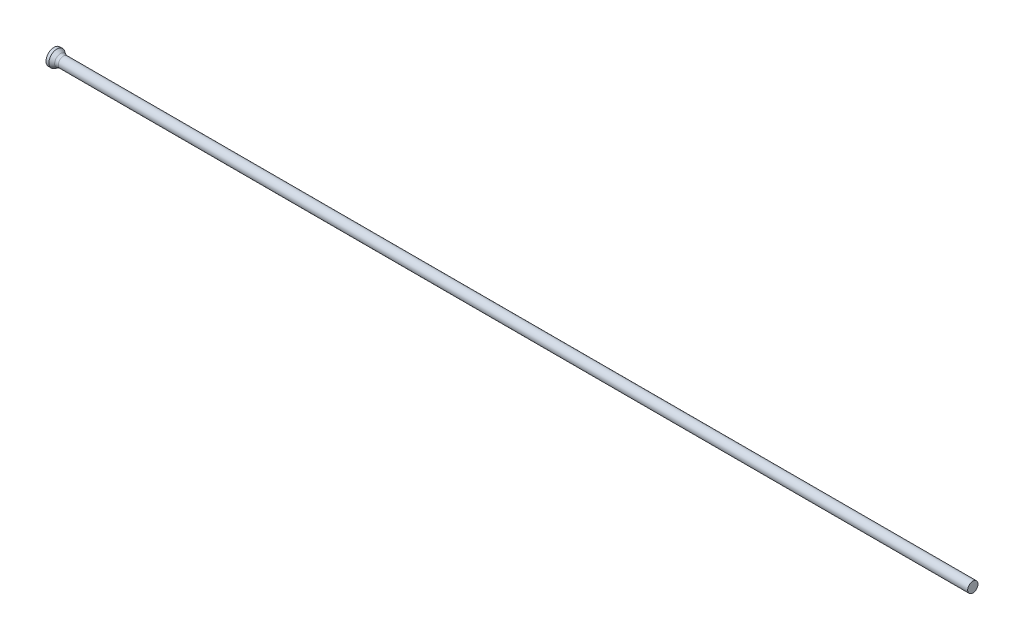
ISO-10303-21;
HEADER;
FILE_DESCRIPTION(('STEP AP214'),'2;1');
FILE_NAME('part.step','',(''),(''),'','','');
FILE_SCHEMA(('AUTOMOTIVE_DESIGN { 1 0 10303 214 1 1 1 1 }'));
ENDSEC;
DATA;
#1=APPLICATION_CONTEXT('core data for automotive mechanical design processes');
#2=APPLICATION_PROTOCOL_DEFINITION('international standard','automotive_design',2000,#1);
#3=PRODUCT_CONTEXT('',#1,'mechanical');
#4=PRODUCT('Part','Part','',(#3));
#5=PRODUCT_RELATED_PRODUCT_CATEGORY('part','',(#4));
#6=PRODUCT_DEFINITION_FORMATION('','',#4);
#7=PRODUCT_DEFINITION_CONTEXT('part definition',#1,'design');
#8=PRODUCT_DEFINITION('design','',#6,#7);
#9=PRODUCT_DEFINITION_SHAPE('','',#8);
#10=(LENGTH_UNIT() NAMED_UNIT(*) SI_UNIT(.MILLI.,.METRE.));
#11=(NAMED_UNIT(*) PLANE_ANGLE_UNIT() SI_UNIT($,.RADIAN.));
#12=(NAMED_UNIT(*) SI_UNIT($,.STERADIAN.) SOLID_ANGLE_UNIT());
#13=UNCERTAINTY_MEASURE_WITH_UNIT(LENGTH_MEASURE(1.E-05),#10,'distance_accuracy_value','');
#14=(GEOMETRIC_REPRESENTATION_CONTEXT(3) GLOBAL_UNCERTAINTY_ASSIGNED_CONTEXT((#13)) GLOBAL_UNIT_ASSIGNED_CONTEXT((#10,
#11,#12)) REPRESENTATION_CONTEXT('',''));
#15=CARTESIAN_POINT('',(0.,0.,0.));
#16=DIRECTION('',(0.,0.,1.));
#17=DIRECTION('',(1.,0.,0.));
#18=AXIS2_PLACEMENT_3D('',#15,#16,#17);
#19=CARTESIAN_POINT('',(0.,0.,0.));
#20=DIRECTION('',(1.,0.,0.));
#21=DIRECTION('',(0.,0.,-1.));
#22=AXIS2_PLACEMENT_3D('',#19,#20,#21);
#23=PLANE('',#22);
#24=CARTESIAN_POINT('',(0.,0.,0.));
#25=DIRECTION('',(-1.,0.,0.));
#26=DIRECTION('',(0.,0.,1.));
#27=AXIS2_PLACEMENT_3D('',#24,#25,#26);
#28=CIRCLE('',#27,1.4);
#29=CARTESIAN_POINT('',(0.,0.,1.4));
#30=VERTEX_POINT('',#29);
#31=EDGE_CURVE('E25',#30,#30,#28,.T.);
#32=ORIENTED_EDGE('',*,*,#31,.T.);
#33=EDGE_LOOP('',(#32));
#34=FACE_BOUND('',#33,.T.);
#35=ADVANCED_FACE('F14',(#34),#23,.F.);
#36=CARTESIAN_POINT('',(0.,0.,0.));
#37=DIRECTION('',(-1.,0.,0.));
#38=DIRECTION('',(0.,0.,1.));
#39=AXIS2_PLACEMENT_3D('',#36,#37,#38);
#40=CYLINDRICAL_SURFACE('',#39,1.4);
#41=ORIENTED_EDGE('',*,*,#31,.F.);
#42=EDGE_LOOP('',(#41));
#43=FACE_BOUND('',#42,.T.);
#44=CARTESIAN_POINT('',(0.503974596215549,0.,0.));
#45=DIRECTION('',(-1.,0.,0.));
#46=DIRECTION('',(0.,0.,1.));
#47=AXIS2_PLACEMENT_3D('',#44,#45,#46);
#48=CIRCLE('',#47,1.4);
#49=CARTESIAN_POINT('',(0.503974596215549,0.,1.4));
#50=VERTEX_POINT('',#49);
#51=EDGE_CURVE('E29',#50,#50,#48,.T.);
#52=ORIENTED_EDGE('',*,*,#51,.T.);
#53=EDGE_LOOP('',(#52));
#54=FACE_BOUND('',#53,.T.);
#55=ADVANCED_FACE('F53',(#43,#54),#40,.T.);
#56=CARTESIAN_POINT('',(1.37,0.,0.));
#57=DIRECTION('',(-1.,0.,0.));
#58=DIRECTION('',(0.,0.,1.));
#59=AXIS2_PLACEMENT_3D('',#56,#57,#58);
#60=CONICAL_SURFACE('',#59,0.9,0.523598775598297);
#61=CARTESIAN_POINT('',(1.13794919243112,0.,0.));
#62=DIRECTION('',(-1.,0.,0.));
#63=DIRECTION('',(0.,0.,1.));
#64=AXIS2_PLACEMENT_3D('',#61,#62,#63);
#65=CIRCLE('',#64,1.03397459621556);
#66=CARTESIAN_POINT('',(1.13794919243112,0.,1.03397459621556));
#67=VERTEX_POINT('',#66);
#68=EDGE_CURVE('E21',#67,#67,#65,.T.);
#69=ORIENTED_EDGE('',*,*,#68,.T.);
#70=EDGE_LOOP('',(#69));
#71=FACE_BOUND('',#70,.T.);
#72=ORIENTED_EDGE('',*,*,#51,.F.);
#73=EDGE_LOOP('',(#72));
#74=FACE_BOUND('',#73,.T.);
#75=ADVANCED_FACE('F50',(#71,#74),#60,.T.);
#76=CARTESIAN_POINT('',(0.,0.,0.));
#77=DIRECTION('',(-1.,0.,0.));
#78=DIRECTION('',(0.,0.,1.));
#79=AXIS2_PLACEMENT_3D('',#76,#77,#78);
#80=CYLINDRICAL_SURFACE('',#79,0.9);
#81=CARTESIAN_POINT('',(1.63794919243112,0.,0.));
#82=DIRECTION('',(-1.,0.,0.));
#83=DIRECTION('',(0.,0.,1.));
#84=AXIS2_PLACEMENT_3D('',#81,#82,#83);
#85=CIRCLE('',#84,0.9);
#86=CARTESIAN_POINT('',(1.63794919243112,0.,0.9));
#87=VERTEX_POINT('',#86);
#88=EDGE_CURVE('E9',#87,#87,#85,.F.);
#89=ORIENTED_EDGE('',*,*,#88,.T.);
#90=EDGE_LOOP('',(#89));
#91=FACE_BOUND('',#90,.T.);
#92=CARTESIAN_POINT('',(160.,0.,0.));
#93=DIRECTION('',(-1.,0.,0.));
#94=DIRECTION('',(0.,0.,1.));
#95=AXIS2_PLACEMENT_3D('',#92,#93,#94);
#96=CIRCLE('',#95,0.9);
#97=CARTESIAN_POINT('',(160.,0.,0.9));
#98=VERTEX_POINT('',#97);
#99=EDGE_CURVE('E34',#98,#98,#96,.T.);
#100=ORIENTED_EDGE('',*,*,#99,.T.);
#101=EDGE_LOOP('',(#100));
#102=FACE_BOUND('',#101,.T.);
#103=ADVANCED_FACE('F38',(#91,#102),#80,.T.);
#104=CARTESIAN_POINT('',(160.,0.9,0.));
#105=DIRECTION('',(-1.,0.,0.));
#106=DIRECTION('',(0.,0.,1.));
#107=AXIS2_PLACEMENT_3D('',#104,#105,#106);
#108=PLANE('',#107);
#109=ORIENTED_EDGE('',*,*,#99,.F.);
#110=EDGE_LOOP('',(#109));
#111=FACE_BOUND('',#110,.T.);
#112=ADVANCED_FACE('F40',(#111),#108,.F.);
#113=CARTESIAN_POINT('',(1.63794919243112,0.,0.));
#114=DIRECTION('',(-1.,0.,0.));
#115=DIRECTION('',(0.,0.,1.));
#116=AXIS2_PLACEMENT_3D('',#113,#114,#115);
#117=TOROIDAL_SURFACE('',#116,1.9,1.);
#118=ORIENTED_EDGE('',*,*,#88,.F.);
#119=EDGE_LOOP('',(#118));
#120=FACE_BOUND('',#119,.T.);
#121=ORIENTED_EDGE('',*,*,#68,.F.);
#122=EDGE_LOOP('',(#121));
#123=FACE_BOUND('',#122,.T.);
#124=ADVANCED_FACE('F16',(#120,#123),#117,.F.);
#125=CLOSED_SHELL('',(#35,#55,#75,#103,#112,#124));
#126=MANIFOLD_SOLID_BREP('B1',#125);
#127=ADVANCED_BREP_SHAPE_REPRESENTATION('',(#18,#126),#14);
#128=SHAPE_DEFINITION_REPRESENTATION(#9,#127);
ENDSEC;
END-ISO-10303-21;
